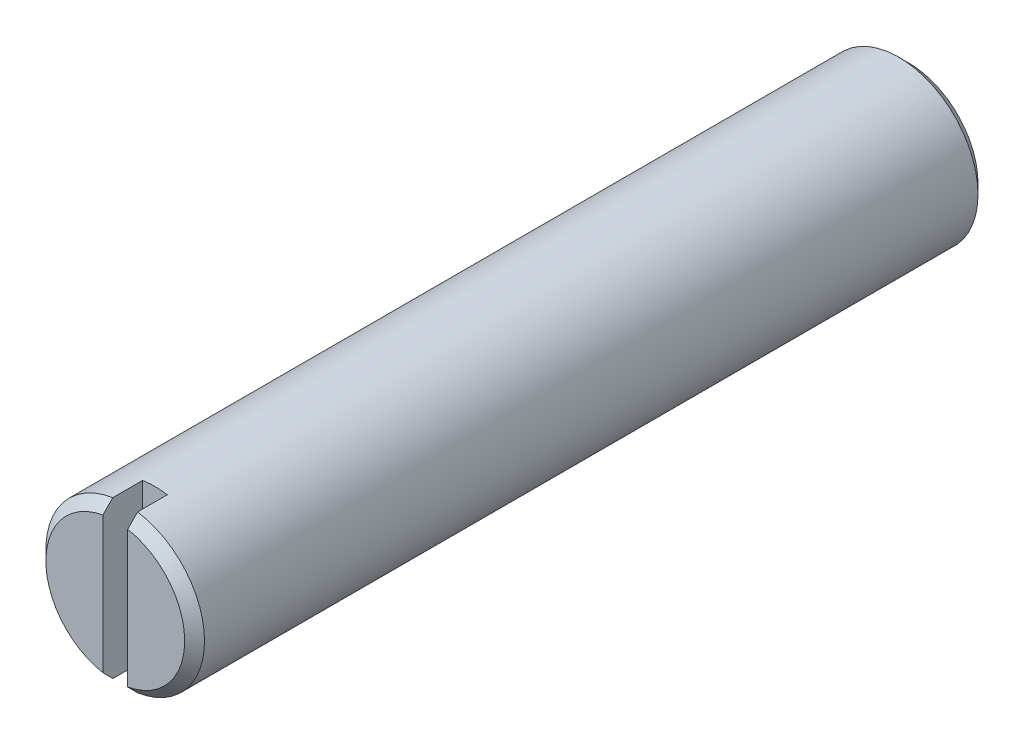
ISO-10303-21;
HEADER;
FILE_DESCRIPTION(('STEP AP214'),'2;1');
FILE_NAME('part.step','',(''),(''),'','','');
FILE_SCHEMA(('AUTOMOTIVE_DESIGN { 1 0 10303 214 1 1 1 1 }'));
ENDSEC;
DATA;
#1=APPLICATION_CONTEXT('core data for automotive mechanical design processes');
#2=APPLICATION_PROTOCOL_DEFINITION('international standard','automotive_design',2000,#1);
#3=PRODUCT_CONTEXT('',#1,'mechanical');
#4=PRODUCT('Part','Part','',(#3));
#5=PRODUCT_RELATED_PRODUCT_CATEGORY('part','',(#4));
#6=PRODUCT_DEFINITION_FORMATION('','',#4);
#7=PRODUCT_DEFINITION_CONTEXT('part definition',#1,'design');
#8=PRODUCT_DEFINITION('design','',#6,#7);
#9=PRODUCT_DEFINITION_SHAPE('','',#8);
#10=(LENGTH_UNIT() NAMED_UNIT(*) SI_UNIT(.MILLI.,.METRE.));
#11=(NAMED_UNIT(*) PLANE_ANGLE_UNIT() SI_UNIT($,.RADIAN.));
#12=(NAMED_UNIT(*) SI_UNIT($,.STERADIAN.) SOLID_ANGLE_UNIT());
#13=UNCERTAINTY_MEASURE_WITH_UNIT(LENGTH_MEASURE(1.E-05),#10,'distance_accuracy_value','');
#14=(GEOMETRIC_REPRESENTATION_CONTEXT(3) GLOBAL_UNCERTAINTY_ASSIGNED_CONTEXT((#13)) GLOBAL_UNIT_ASSIGNED_CONTEXT((#10,
#11,#12)) REPRESENTATION_CONTEXT('',''));
#15=CARTESIAN_POINT('',(0.,0.,0.));
#16=DIRECTION('',(0.,0.,1.));
#17=DIRECTION('',(1.,0.,0.));
#18=AXIS2_PLACEMENT_3D('',#15,#16,#17);
#19=CARTESIAN_POINT('',(0.,0.,40.));
#20=DIRECTION('',(0.,0.,-1.));
#21=DIRECTION('',(-1.,0.,0.));
#22=AXIS2_PLACEMENT_3D('',#19,#20,#21);
#23=PLANE('',#22);
#24=DIRECTION('',(0.,1.,0.));
#25=VECTOR('',#24,1.);
#26=CARTESIAN_POINT('',(-0.625,4.5,40.));
#27=LINE('',#26,#25);
#28=CARTESIAN_POINT('',(-0.625,-3.44374432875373,40.0000000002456));
#29=VERTEX_POINT('',#28);
#30=CARTESIAN_POINT('',(-0.625,3.44374432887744,40.0000000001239));
#31=VERTEX_POINT('',#30);
#32=EDGE_CURVE('E148',#29,#31,#27,.T.);
#33=ORIENTED_EDGE('',*,*,#32,.T.);
#34=CARTESIAN_POINT('',(0.,0.,40.0000000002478));
#35=DIRECTION('',(0.,0.,-1.));
#36=DIRECTION('',(-1.,0.,0.));
#37=AXIS2_PLACEMENT_3D('',#34,#35,#36);
#38=CIRCLE('',#37,3.5000000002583);
#39=EDGE_CURVE('E79',#29,#31,#38,.T.);
#40=ORIENTED_EDGE('',*,*,#39,.F.);
#41=EDGE_LOOP('',(#33,#40));
#42=FACE_BOUND('',#41,.T.);
#43=ADVANCED_FACE('F15',(#42),#23,.F.);
#44=CARTESIAN_POINT('',(0.,0.,40.));
#45=DIRECTION('',(0.,0.,-1.));
#46=DIRECTION('',(-1.,0.,0.));
#47=AXIS2_PLACEMENT_3D('',#44,#45,#46);
#48=PLANE('',#47);
#49=DIRECTION('',(0.,1.,0.));
#50=VECTOR('',#49,1.);
#51=CARTESIAN_POINT('',(0.624999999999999,-4.5,40.));
#52=LINE('',#51,#50);
#53=CARTESIAN_POINT('',(0.624999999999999,3.44374432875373,40.0000000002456));
#54=VERTEX_POINT('',#53);
#55=CARTESIAN_POINT('',(0.624999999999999,-3.44374432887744,40.0000000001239));
#56=VERTEX_POINT('',#55);
#57=EDGE_CURVE('E67',#54,#56,#52,.F.);
#58=ORIENTED_EDGE('',*,*,#57,.T.);
#59=CARTESIAN_POINT('',(0.,0.,40.0000000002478));
#60=DIRECTION('',(0.,0.,-1.));
#61=DIRECTION('',(-1.,0.,0.));
#62=AXIS2_PLACEMENT_3D('',#59,#60,#61);
#63=CIRCLE('',#62,3.5000000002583);
#64=EDGE_CURVE('E18',#54,#56,#63,.T.);
#65=ORIENTED_EDGE('',*,*,#64,.F.);
#66=EDGE_LOOP('',(#58,#65));
#67=FACE_BOUND('',#66,.T.);
#68=ADVANCED_FACE('F68',(#67),#48,.F.);
#69=CARTESIAN_POINT('',(0.,0.,0.));
#70=DIRECTION('',(0.,0.,-1.));
#71=DIRECTION('',(-1.,0.,0.));
#72=AXIS2_PLACEMENT_3D('',#69,#70,#71);
#73=PLANE('',#72);
#74=CARTESIAN_POINT('',(0.,0.,-2.27373675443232E-10));
#75=DIRECTION('',(0.,0.,1.));
#76=DIRECTION('',(1.,0.,0.));
#77=AXIS2_PLACEMENT_3D('',#74,#75,#76);
#78=CIRCLE('',#77,3.50000000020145);
#79=CARTESIAN_POINT('',(3.50000000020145,0.,-2.27373675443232E-10));
#80=VERTEX_POINT('',#79);
#81=EDGE_CURVE('E152',#80,#80,#78,.T.);
#82=ORIENTED_EDGE('',*,*,#81,.F.);
#83=EDGE_LOOP('',(#82));
#84=FACE_BOUND('',#83,.T.);
#85=ADVANCED_FACE('F111',(#84),#73,.T.);
#86=CARTESIAN_POINT('',(0.,0.,39.4999999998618));
#87=DIRECTION('',(0.,0.,-1.));
#88=DIRECTION('',(-1.,0.,0.));
#89=AXIS2_PLACEMENT_3D('',#86,#87,#88);
#90=CONICAL_SURFACE('',#89,3.99999999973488,0.785398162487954);
#91=CARTESIAN_POINT('',(0.624999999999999,3.95087015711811,39.4999999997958));
#92=CARTESIAN_POINT('',(0.624999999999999,3.86642891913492,39.5834142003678));
#93=CARTESIAN_POINT('',(0.624999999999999,3.78194781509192,39.6667879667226));
#94=CARTESIAN_POINT('',(0.624999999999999,3.61290587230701,39.8334546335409));
#95=CARTESIAN_POINT('',(0.624999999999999,3.52834503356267,39.9167475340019));
#96=CARTESIAN_POINT('',(0.624999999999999,3.44374432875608,40.0000000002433));
#97=B_SPLINE_CURVE_WITH_KNOTS('',3,(#91,#92,#93,#94,#95,#96),.UNSPECIFIED.,.F.,.F.,(4,2,4),(0.,
0.356081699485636,0.712163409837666),.UNSPECIFIED.);
#98=CARTESIAN_POINT('',(0.624999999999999,3.95087015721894,39.4999999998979));
#99=VERTEX_POINT('',#98);
#100=EDGE_CURVE('E78',#99,#54,#97,.T.);
#101=ORIENTED_EDGE('',*,*,#100,.T.);
#102=ORIENTED_EDGE('',*,*,#64,.T.);
#103=CARTESIAN_POINT('',(0.624999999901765,-3.44374432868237,40.0000000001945));
#104=CARTESIAN_POINT('',(0.624999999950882,-3.52834503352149,39.9167475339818));
#105=CARTESIAN_POINT('',(0.624999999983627,-3.61290587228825,39.8334546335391));
#106=CARTESIAN_POINT('',(0.625000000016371,-3.78194781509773,39.6667879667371));
#107=CARTESIAN_POINT('',(0.625000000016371,-3.86642891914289,39.5834142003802));
#108=CARTESIAN_POINT('',(0.624999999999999,-3.95087015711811,39.4999999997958));
#109=B_SPLINE_CURVE_WITH_KNOTS('',3,(#103,#104,#105,#106,#107,#108),.UNSPECIFIED.,.F.,.F.,(4,2,
4),(0.,0.356081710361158,0.712163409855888),.UNSPECIFIED.);
#110=CARTESIAN_POINT('',(0.624999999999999,-3.95087015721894,39.4999999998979));
#111=VERTEX_POINT('',#110);
#112=EDGE_CURVE('E72',#56,#111,#109,.T.);
#113=ORIENTED_EDGE('',*,*,#112,.T.);
#114=CARTESIAN_POINT('',(0.,0.,39.5));
#115=DIRECTION('',(0.,0.,1.));
#116=DIRECTION('',(1.,0.,0.));
#117=AXIS2_PLACEMENT_3D('',#114,#115,#116);
#118=CIRCLE('',#117,4.);
#119=EDGE_CURVE('E154',#99,#111,#118,.F.);
#120=ORIENTED_EDGE('',*,*,#119,.F.);
#121=EDGE_LOOP('',(#101,#102,#113,#120));
#122=FACE_BOUND('',#121,.T.);
#123=ADVANCED_FACE('F76',(#122),#90,.T.);
#124=CARTESIAN_POINT('',(0.,0.,39.4999999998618));
#125=DIRECTION('',(0.,0.,-1.));
#126=DIRECTION('',(-1.,0.,0.));
#127=AXIS2_PLACEMENT_3D('',#124,#125,#126);
#128=CONICAL_SURFACE('',#127,3.99999999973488,0.785398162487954);
#129=CARTESIAN_POINT('',(-0.625,-3.95087015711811,39.4999999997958));
#130=CARTESIAN_POINT('',(-0.625,-3.86642891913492,39.5834142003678));
#131=CARTESIAN_POINT('',(-0.625,-3.78194781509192,39.6667879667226));
#132=CARTESIAN_POINT('',(-0.625,-3.61290587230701,39.8334546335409));
#133=CARTESIAN_POINT('',(-0.625,-3.52834503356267,39.9167475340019));
#134=CARTESIAN_POINT('',(-0.625,-3.44374432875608,40.0000000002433));
#135=B_SPLINE_CURVE_WITH_KNOTS('',3,(#129,#130,#131,#132,#133,#134),.UNSPECIFIED.,.F.,.F.,(4,2,
4),(0.,0.356081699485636,0.712163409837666),.UNSPECIFIED.);
#136=CARTESIAN_POINT('',(-0.625,-3.95087015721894,39.4999999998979));
#137=VERTEX_POINT('',#136);
#138=EDGE_CURVE('E97',#137,#29,#135,.T.);
#139=ORIENTED_EDGE('',*,*,#138,.T.);
#140=ORIENTED_EDGE('',*,*,#39,.T.);
#141=CARTESIAN_POINT('',(-0.624999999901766,3.44374432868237,40.0000000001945));
#142=CARTESIAN_POINT('',(-0.624999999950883,3.52834503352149,39.9167475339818));
#143=CARTESIAN_POINT('',(-0.624999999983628,3.61290587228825,39.8334546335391));
#144=CARTESIAN_POINT('',(-0.625000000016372,3.78194781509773,39.6667879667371));
#145=CARTESIAN_POINT('',(-0.625000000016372,3.86642891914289,39.5834142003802));
#146=CARTESIAN_POINT('',(-0.625,3.95087015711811,39.4999999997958));
#147=B_SPLINE_CURVE_WITH_KNOTS('',3,(#141,#142,#143,#144,#145,#146),.UNSPECIFIED.,.F.,.F.,(4,2,
4),(0.,0.356081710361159,0.712163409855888),.UNSPECIFIED.);
#148=CARTESIAN_POINT('',(-0.625,3.95087015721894,39.4999999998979));
#149=VERTEX_POINT('',#148);
#150=EDGE_CURVE('E166',#31,#149,#147,.T.);
#151=ORIENTED_EDGE('',*,*,#150,.T.);
#152=CARTESIAN_POINT('',(0.,0.,39.5));
#153=DIRECTION('',(0.,0.,1.));
#154=DIRECTION('',(1.,0.,0.));
#155=AXIS2_PLACEMENT_3D('',#152,#153,#154);
#156=CIRCLE('',#155,4.);
#157=EDGE_CURVE('E144',#137,#149,#156,.F.);
#158=ORIENTED_EDGE('',*,*,#157,.F.);
#159=EDGE_LOOP('',(#139,#140,#151,#158));
#160=FACE_BOUND('',#159,.T.);
#161=ADVANCED_FACE('F110',(#160),#128,.T.);
#162=CARTESIAN_POINT('',(-0.625,4.5,40.));
#163=DIRECTION('',(-1.,0.,0.));
#164=DIRECTION('',(0.,0.,1.));
#165=AXIS2_PLACEMENT_3D('',#162,#163,#164);
#166=PLANE('',#165);
#167=DIRECTION('',(0.,0.,1.));
#168=VECTOR('',#167,1.);
#169=CARTESIAN_POINT('',(-0.625,-3.95087015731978,0.));
#170=LINE('',#169,#168);
#171=CARTESIAN_POINT('',(-0.625,-3.95087015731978,38.));
#172=VERTEX_POINT('',#171);
#173=EDGE_CURVE('E151',#172,#137,#170,.T.);
#174=ORIENTED_EDGE('',*,*,#173,.F.);
#175=DIRECTION('',(0.,1.,0.));
#176=VECTOR('',#175,1.);
#177=CARTESIAN_POINT('',(-0.625,0.,38.));
#178=LINE('',#177,#176);
#179=CARTESIAN_POINT('',(-0.625,3.95087015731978,38.));
#180=VERTEX_POINT('',#179);
#181=EDGE_CURVE('E73',#180,#172,#178,.F.);
#182=ORIENTED_EDGE('',*,*,#181,.F.);
#183=DIRECTION('',(0.,0.,1.));
#184=VECTOR('',#183,1.);
#185=CARTESIAN_POINT('',(-0.625,3.95087015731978,0.));
#186=LINE('',#185,#184);
#187=EDGE_CURVE('E141',#149,#180,#186,.F.);
#188=ORIENTED_EDGE('',*,*,#187,.F.);
#189=ORIENTED_EDGE('',*,*,#150,.F.);
#190=ORIENTED_EDGE('',*,*,#32,.F.);
#191=ORIENTED_EDGE('',*,*,#138,.F.);
#192=EDGE_LOOP('',(#174,#182,#188,#189,#190,#191));
#193=FACE_BOUND('',#192,.T.);
#194=ADVANCED_FACE('F175',(#193),#166,.F.);
#195=CARTESIAN_POINT('',(0.,0.,38.));
#196=DIRECTION('',(0.,0.,1.));
#197=DIRECTION('',(1.,0.,0.));
#198=AXIS2_PLACEMENT_3D('',#195,#196,#197);
#199=PLANE('',#198);
#200=CARTESIAN_POINT('',(0.,0.,38.));
#201=DIRECTION('',(0.,0.,1.));
#202=DIRECTION('',(1.,0.,0.));
#203=AXIS2_PLACEMENT_3D('',#200,#201,#202);
#204=CIRCLE('',#203,4.);
#205=CARTESIAN_POINT('',(0.624999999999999,3.95087015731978,38.));
#206=VERTEX_POINT('',#205);
#207=EDGE_CURVE('E138',#180,#206,#204,.F.);
#208=ORIENTED_EDGE('',*,*,#207,.F.);
#209=ORIENTED_EDGE('',*,*,#181,.T.);
#210=CARTESIAN_POINT('',(0.,0.,38.));
#211=DIRECTION('',(0.,0.,1.));
#212=DIRECTION('',(1.,0.,0.));
#213=AXIS2_PLACEMENT_3D('',#210,#211,#212);
#214=CIRCLE('',#213,4.);
#215=CARTESIAN_POINT('',(0.624999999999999,-3.95087015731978,38.));
#216=VERTEX_POINT('',#215);
#217=EDGE_CURVE('E149',#216,#172,#214,.F.);
#218=ORIENTED_EDGE('',*,*,#217,.F.);
#219=DIRECTION('',(0.,1.,0.));
#220=VECTOR('',#219,1.);
#221=CARTESIAN_POINT('',(0.624999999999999,-4.5,38.));
#222=LINE('',#221,#220);
#223=EDGE_CURVE('E33',#216,#206,#222,.T.);
#224=ORIENTED_EDGE('',*,*,#223,.T.);
#225=EDGE_LOOP('',(#208,#209,#218,#224));
#226=FACE_BOUND('',#225,.T.);
#227=ADVANCED_FACE('F178',(#226),#199,.T.);
#228=CARTESIAN_POINT('',(0.624999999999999,-4.5,40.));
#229=DIRECTION('',(1.,0.,0.));
#230=DIRECTION('',(0.,0.,-1.));
#231=AXIS2_PLACEMENT_3D('',#228,#229,#230);
#232=PLANE('',#231);
#233=DIRECTION('',(0.,0.,1.));
#234=VECTOR('',#233,1.);
#235=CARTESIAN_POINT('',(0.625,3.95087015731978,0.));
#236=LINE('',#235,#234);
#237=EDGE_CURVE('E24',#206,#99,#236,.T.);
#238=ORIENTED_EDGE('',*,*,#237,.F.);
#239=ORIENTED_EDGE('',*,*,#223,.F.);
#240=DIRECTION('',(0.,0.,1.));
#241=VECTOR('',#240,1.);
#242=CARTESIAN_POINT('',(0.624999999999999,-3.95087015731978,0.));
#243=LINE('',#242,#241);
#244=EDGE_CURVE('E82',#111,#216,#243,.F.);
#245=ORIENTED_EDGE('',*,*,#244,.F.);
#246=ORIENTED_EDGE('',*,*,#112,.F.);
#247=ORIENTED_EDGE('',*,*,#57,.F.);
#248=ORIENTED_EDGE('',*,*,#100,.F.);
#249=EDGE_LOOP('',(#238,#239,#245,#246,#247,#248));
#250=FACE_BOUND('',#249,.T.);
#251=ADVANCED_FACE('F80',(#250),#232,.F.);
#252=CARTESIAN_POINT('',(0.,0.,0.50000000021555));
#253=DIRECTION('',(0.,0.,1.));
#254=DIRECTION('',(1.,0.,0.));
#255=AXIS2_PLACEMENT_3D('',#252,#253,#254);
#256=CONICAL_SURFACE('',#255,3.99999999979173,0.785398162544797);
#257=ORIENTED_EDGE('',*,*,#81,.T.);
#258=EDGE_LOOP('',(#257));
#259=FACE_BOUND('',#258,.T.);
#260=CARTESIAN_POINT('',(0.,0.,0.5));
#261=DIRECTION('',(0.,0.,1.));
#262=DIRECTION('',(1.,0.,0.));
#263=AXIS2_PLACEMENT_3D('',#260,#261,#262);
#264=CIRCLE('',#263,4.);
#265=CARTESIAN_POINT('',(4.,0.,0.5));
#266=VERTEX_POINT('',#265);
#267=EDGE_CURVE('E10',#266,#266,#264,.T.);
#268=ORIENTED_EDGE('',*,*,#267,.F.);
#269=EDGE_LOOP('',(#268));
#270=FACE_BOUND('',#269,.T.);
#271=ADVANCED_FACE('F125',(#259,#270),#256,.T.);
#272=CARTESIAN_POINT('',(0.,0.,0.));
#273=DIRECTION('',(0.,0.,1.));
#274=DIRECTION('',(1.,0.,0.));
#275=AXIS2_PLACEMENT_3D('',#272,#273,#274);
#276=CYLINDRICAL_SURFACE('',#275,4.);
#277=ORIENTED_EDGE('',*,*,#267,.T.);
#278=EDGE_LOOP('',(#277));
#279=FACE_BOUND('',#278,.T.);
#280=ORIENTED_EDGE('',*,*,#207,.T.);
#281=ORIENTED_EDGE('',*,*,#237,.T.);
#282=ORIENTED_EDGE('',*,*,#119,.T.);
#283=ORIENTED_EDGE('',*,*,#244,.T.);
#284=ORIENTED_EDGE('',*,*,#217,.T.);
#285=ORIENTED_EDGE('',*,*,#173,.T.);
#286=ORIENTED_EDGE('',*,*,#157,.T.);
#287=ORIENTED_EDGE('',*,*,#187,.T.);
#288=EDGE_LOOP('',(#280,#281,#282,#283,#284,#285,#286,#287));
#289=FACE_BOUND('',#288,.T.);
#290=ADVANCED_FACE('F123',(#279,#289),#276,.T.);
#291=CLOSED_SHELL('',(#43,#68,#85,#123,#161,#194,#227,#251,#271,#290));
#292=MANIFOLD_SOLID_BREP('B1',#291);
#293=ADVANCED_BREP_SHAPE_REPRESENTATION('',(#18,#292),#14);
#294=SHAPE_DEFINITION_REPRESENTATION(#9,#293);
ENDSEC;
END-ISO-10303-21;
